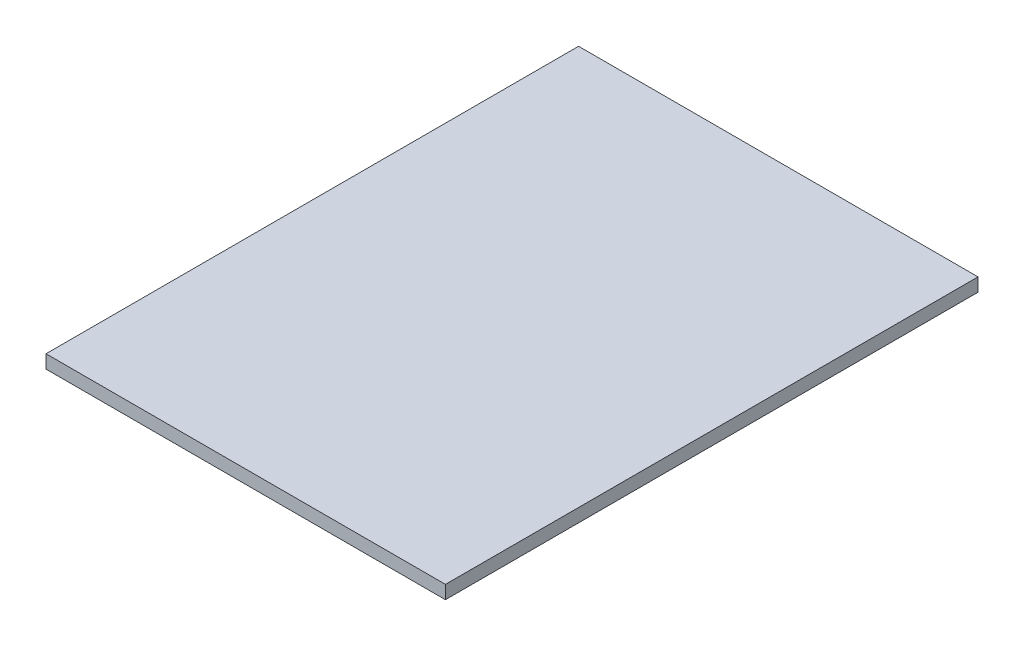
from build123d import *

# Parameters (mm, degrees)
SKETCH2_W           = 150
SKETCH2_H           = 200
BOSS_EXTRUDE1_DEPTH = 5


with BuildPart() as part:
    # Sketch2 → Boss-Extrude1 (new body)
    with BuildSketch(Plane(origin=(0, 0, 0), x_dir=(1, 0, 0), z_dir=(0, 1, 0))):
        with Locations((75, 100)):
            Rectangle(SKETCH2_W, SKETCH2_H)
    extrude(amount=BOSS_EXTRUDE1_DEPTH)


solid = part.part
